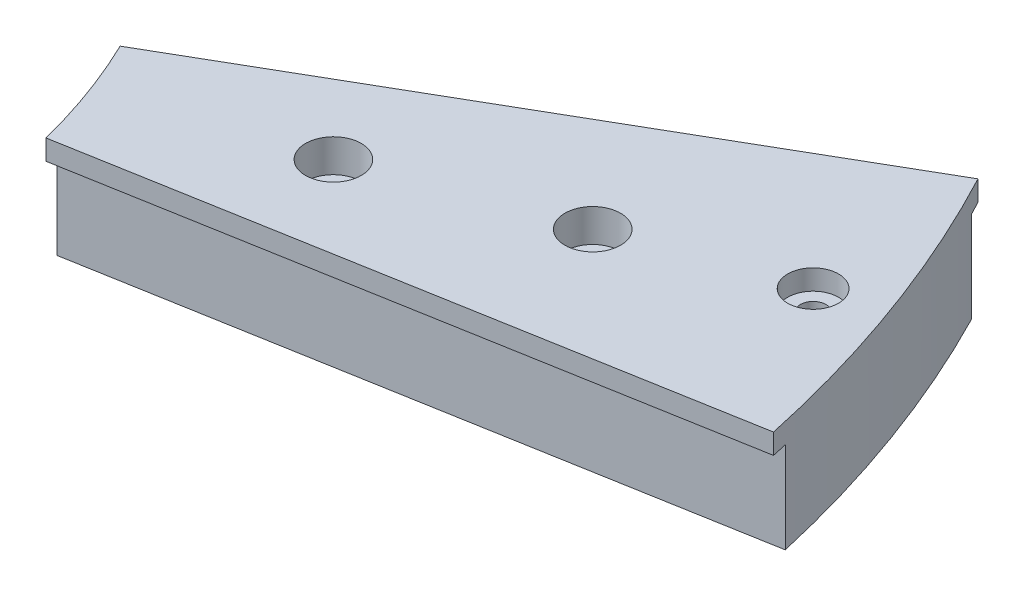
ISO-10303-21;
HEADER;
FILE_DESCRIPTION(('STEP AP214'),'2;1');
FILE_NAME('part.step','',(''),(''),'','','');
FILE_SCHEMA(('AUTOMOTIVE_DESIGN { 1 0 10303 214 1 1 1 1 }'));
ENDSEC;
DATA;
#1=APPLICATION_CONTEXT('core data for automotive mechanical design processes');
#2=APPLICATION_PROTOCOL_DEFINITION('international standard','automotive_design',2000,#1);
#3=PRODUCT_CONTEXT('',#1,'mechanical');
#4=PRODUCT('Part','Part','',(#3));
#5=PRODUCT_RELATED_PRODUCT_CATEGORY('part','',(#4));
#6=PRODUCT_DEFINITION_FORMATION('','',#4);
#7=PRODUCT_DEFINITION_CONTEXT('part definition',#1,'design');
#8=PRODUCT_DEFINITION('design','',#6,#7);
#9=PRODUCT_DEFINITION_SHAPE('','',#8);
#10=(LENGTH_UNIT() NAMED_UNIT(*) SI_UNIT(.MILLI.,.METRE.));
#11=(NAMED_UNIT(*) PLANE_ANGLE_UNIT() SI_UNIT($,.RADIAN.));
#12=(NAMED_UNIT(*) SI_UNIT($,.STERADIAN.) SOLID_ANGLE_UNIT());
#13=UNCERTAINTY_MEASURE_WITH_UNIT(LENGTH_MEASURE(1.E-05),#10,'distance_accuracy_value','');
#14=(GEOMETRIC_REPRESENTATION_CONTEXT(3) GLOBAL_UNCERTAINTY_ASSIGNED_CONTEXT((#13)) GLOBAL_UNIT_ASSIGNED_CONTEXT((#10,
#11,#12)) REPRESENTATION_CONTEXT('',''));
#15=CARTESIAN_POINT('',(0.,0.,0.));
#16=DIRECTION('',(0.,0.,1.));
#17=DIRECTION('',(1.,0.,0.));
#18=AXIS2_PLACEMENT_3D('',#15,#16,#17);
#19=CARTESIAN_POINT('',(0.,17.4625,0.));
#20=DIRECTION('',(0.,-1.,0.));
#21=DIRECTION('',(0.,0.,-1.));
#22=AXIS2_PLACEMENT_3D('',#19,#20,#21);
#23=CYLINDRICAL_SURFACE('',#22,96.8375);
#24=DIRECTION('',(0.,-1.,0.));
#25=VECTOR('',#24,1.);
#26=CARTESIAN_POINT('',(93.2378191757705,17.4625,-26.1574173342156));
#27=LINE('',#26,#25);
#28=CARTESIAN_POINT('',(93.2378191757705,14.2875,-26.1574173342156));
#29=VERTEX_POINT('',#28);
#30=CARTESIAN_POINT('',(93.2378191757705,0.,-26.1574173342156));
#31=VERTEX_POINT('',#30);
#32=EDGE_CURVE('E58',#29,#31,#27,.T.);
#33=ORIENTED_EDGE('',*,*,#32,.F.);
#34=CARTESIAN_POINT('',(0.,14.2875,0.));
#35=DIRECTION('',(0.,-1.,0.));
#36=DIRECTION('',(0.,0.,-1.));
#37=AXIS2_PLACEMENT_3D('',#34,#35,#36);
#38=CIRCLE('',#37,96.8375);
#39=CARTESIAN_POINT('',(93.8659717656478,14.2875,-23.8050572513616));
#40=VERTEX_POINT('',#39);
#41=EDGE_CURVE('E178',#40,#29,#38,.F.);
#42=ORIENTED_EDGE('',*,*,#41,.F.);
#43=DIRECTION('',(0.,-1.,0.));
#44=VECTOR('',#43,1.);
#45=CARTESIAN_POINT('',(93.8659717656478,17.4625,-23.8050572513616));
#46=LINE('',#45,#44);
#47=CARTESIAN_POINT('',(93.8659717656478,17.4625,-23.8050572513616));
#48=VERTEX_POINT('',#47);
#49=EDGE_CURVE('E205',#48,#40,#46,.T.);
#50=ORIENTED_EDGE('',*,*,#49,.F.);
#51=CARTESIAN_POINT('',(0.,17.4625,0.));
#52=DIRECTION('',(0.,-1.,0.));
#53=DIRECTION('',(0.,0.,1.));
#54=AXIS2_PLACEMENT_3D('',#51,#52,#53);
#55=CIRCLE('',#54,96.8375);
#56=CARTESIAN_POINT('',(87.2071019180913,17.4625,-42.1001517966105));
#57=VERTEX_POINT('',#56);
#58=EDGE_CURVE('E181',#57,#48,#55,.T.);
#59=ORIENTED_EDGE('',*,*,#58,.F.);
#60=DIRECTION('',(0.,-1.,0.));
#61=VECTOR('',#60,1.);
#62=CARTESIAN_POINT('',(87.2071019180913,17.4625,-42.1001517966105));
#63=LINE('',#62,#61);
#64=CARTESIAN_POINT('',(87.2071019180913,14.2875,-42.1001517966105));
#65=VERTEX_POINT('',#64);
#66=EDGE_CURVE('E191',#57,#65,#63,.T.);
#67=ORIENTED_EDGE('',*,*,#66,.T.);
#68=CARTESIAN_POINT('',(88.2379770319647,14.2875,-39.8943707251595));
#69=VERTEX_POINT('',#68);
#70=EDGE_CURVE('E175',#69,#65,#38,.F.);
#71=ORIENTED_EDGE('',*,*,#70,.F.);
#72=DIRECTION('',(0.,-1.,0.));
#73=VECTOR('',#72,1.);
#74=CARTESIAN_POINT('',(88.2379770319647,17.4625,-39.8943707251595));
#75=LINE('',#74,#73);
#76=CARTESIAN_POINT('',(88.2379770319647,0.,-39.8943707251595));
#77=VERTEX_POINT('',#76);
#78=EDGE_CURVE('E171',#77,#69,#75,.F.);
#79=ORIENTED_EDGE('',*,*,#78,.F.);
#80=CARTESIAN_POINT('',(0.,0.,0.));
#81=DIRECTION('',(0.,-1.,0.));
#82=DIRECTION('',(0.,0.,1.));
#83=AXIS2_PLACEMENT_3D('',#80,#81,#82);
#84=CIRCLE('',#83,96.8375);
#85=EDGE_CURVE('E192',#77,#31,#84,.T.);
#86=ORIENTED_EDGE('',*,*,#85,.T.);
#87=EDGE_LOOP('',(#33,#42,#50,#59,#67,#71,#79,#86));
#88=FACE_BOUND('',#87,.T.);
#89=ADVANCED_FACE('F34',(#88),#23,.F.);
#90=CARTESIAN_POINT('',(93.8659717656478,17.4625,-23.8050572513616));
#91=DIRECTION('',(-0.173648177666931,0.,-0.984807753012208));
#92=DIRECTION('',(-0.984807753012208,0.,0.173648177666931));
#93=AXIS2_PLACEMENT_3D('',#90,#91,#92);
#94=PLANE('',#93);
#95=DIRECTION('',(-0.984807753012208,0.,0.173648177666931));
#96=VECTOR('',#95,1.);
#97=CARTESIAN_POINT('',(93.8659717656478,14.2875,-23.8050572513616));
#98=LINE('',#97,#96);
#99=CARTESIAN_POINT('',(190.9267885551,14.2875,-40.9194980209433));
#100=VERTEX_POINT('',#99);
#101=EDGE_CURVE('E179',#100,#40,#98,.T.);
#102=ORIENTED_EDGE('',*,*,#101,.F.);
#103=DIRECTION('',(0.,-1.,0.));
#104=VECTOR('',#103,1.);
#105=CARTESIAN_POINT('',(190.9267885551,17.4625,-40.9194980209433));
#106=LINE('',#105,#104);
#107=CARTESIAN_POINT('',(190.9267885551,17.4625,-40.9194980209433));
#108=VERTEX_POINT('',#107);
#109=EDGE_CURVE('E202',#108,#100,#106,.T.);
#110=ORIENTED_EDGE('',*,*,#109,.F.);
#111=DIRECTION('',(0.984807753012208,0.,-0.173648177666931));
#112=VECTOR('',#111,1.);
#113=CARTESIAN_POINT('',(93.8659717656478,17.4625,-23.8050572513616));
#114=LINE('',#113,#112);
#115=EDGE_CURVE('E184',#48,#108,#114,.T.);
#116=ORIENTED_EDGE('',*,*,#115,.F.);
#117=ORIENTED_EDGE('',*,*,#49,.T.);
#118=EDGE_LOOP('',(#102,#110,#116,#117));
#119=FACE_BOUND('',#118,.T.);
#120=ADVANCED_FACE('F235',(#119),#94,.F.);
#121=CARTESIAN_POINT('',(0.,17.4625,0.));
#122=DIRECTION('',(0.,-1.,0.));
#123=DIRECTION('',(0.,0.,-1.));
#124=AXIS2_PLACEMENT_3D('',#121,#122,#123);
#125=CYLINDRICAL_SURFACE('',#124,195.2625);
#126=DIRECTION('',(0.,-1.,0.));
#127=VECTOR('',#126,1.);
#128=CARTESIAN_POINT('',(173.683813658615,17.4625,-89.2265475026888));
#129=LINE('',#128,#127);
#130=CARTESIAN_POINT('',(173.683813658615,14.2875,-89.2265475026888));
#131=VERTEX_POINT('',#130);
#132=CARTESIAN_POINT('',(173.683813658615,0.,-89.2265475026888));
#133=VERTEX_POINT('',#132);
#134=EDGE_CURVE('E50',#131,#133,#129,.T.);
#135=ORIENTED_EDGE('',*,*,#134,.F.);
#136=CARTESIAN_POINT('',(0.,14.2875,0.));
#137=DIRECTION('',(0.,-1.,0.));
#138=DIRECTION('',(0.,0.,-1.));
#139=AXIS2_PLACEMENT_3D('',#136,#137,#138);
#140=CIRCLE('',#139,195.2625);
#141=CARTESIAN_POINT('',(172.560951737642,14.2875,-91.379219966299));
#142=VERTEX_POINT('',#141);
#143=EDGE_CURVE('E173',#142,#131,#140,.T.);
#144=ORIENTED_EDGE('',*,*,#143,.F.);
#145=DIRECTION('',(0.,-1.,0.));
#146=VECTOR('',#145,1.);
#147=CARTESIAN_POINT('',(172.560951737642,17.4625,-91.3792199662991));
#148=LINE('',#147,#146);
#149=CARTESIAN_POINT('',(172.560951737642,17.4625,-91.3792199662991));
#150=VERTEX_POINT('',#149);
#151=EDGE_CURVE('E199',#150,#142,#148,.T.);
#152=ORIENTED_EDGE('',*,*,#151,.F.);
#153=CARTESIAN_POINT('',(0.,17.4625,0.));
#154=DIRECTION('',(0.,1.,0.));
#155=DIRECTION('',(0.,0.,1.));
#156=AXIS2_PLACEMENT_3D('',#153,#154,#155);
#157=CIRCLE('',#156,195.2625);
#158=EDGE_CURVE('E187',#108,#150,#157,.T.);
#159=ORIENTED_EDGE('',*,*,#158,.F.);
#160=ORIENTED_EDGE('',*,*,#109,.T.);
#161=CARTESIAN_POINT('',(190.40323950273,14.2875,-43.2903025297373));
#162=VERTEX_POINT('',#161);
#163=EDGE_CURVE('E176',#162,#100,#140,.T.);
#164=ORIENTED_EDGE('',*,*,#163,.F.);
#165=DIRECTION('',(0.,-1.,0.));
#166=VECTOR('',#165,1.);
#167=CARTESIAN_POINT('',(190.40323950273,17.4625,-43.2903025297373));
#168=LINE('',#167,#166);
#169=CARTESIAN_POINT('',(190.40323950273,0.,-43.2903025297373));
#170=VERTEX_POINT('',#169);
#171=EDGE_CURVE('E167',#170,#162,#168,.F.);
#172=ORIENTED_EDGE('',*,*,#171,.F.);
#173=CARTESIAN_POINT('',(0.,0.,0.));
#174=DIRECTION('',(0.,1.,0.));
#175=DIRECTION('',(0.,0.,1.));
#176=AXIS2_PLACEMENT_3D('',#173,#174,#175);
#177=CIRCLE('',#176,195.2625);
#178=EDGE_CURVE('E185',#170,#133,#177,.T.);
#179=ORIENTED_EDGE('',*,*,#178,.T.);
#180=EDGE_LOOP('',(#135,#144,#152,#159,#160,#164,#172,#179));
#181=FACE_BOUND('',#180,.T.);
#182=ADVANCED_FACE('F240',(#181),#125,.T.);
#183=CARTESIAN_POINT('',(87.2071019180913,17.4625,-42.1001517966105));
#184=DIRECTION('',(0.500000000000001,0.,0.866025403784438));
#185=DIRECTION('',(0.866025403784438,0.,-0.500000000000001));
#186=AXIS2_PLACEMENT_3D('',#183,#184,#185);
#187=PLANE('',#186);
#188=DIRECTION('',(0.866025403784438,0.,-0.500000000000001));
#189=VECTOR('',#188,1.);
#190=CARTESIAN_POINT('',(87.2071019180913,14.2875,-42.1001517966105));
#191=LINE('',#190,#189);
#192=EDGE_CURVE('E11',#65,#142,#191,.T.);
#193=ORIENTED_EDGE('',*,*,#192,.F.);
#194=ORIENTED_EDGE('',*,*,#66,.F.);
#195=DIRECTION('',(-0.866025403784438,0.,0.500000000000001));
#196=VECTOR('',#195,1.);
#197=CARTESIAN_POINT('',(87.2071019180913,17.4625,-42.1001517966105));
#198=LINE('',#197,#196);
#199=EDGE_CURVE('E189',#150,#57,#198,.T.);
#200=ORIENTED_EDGE('',*,*,#199,.F.);
#201=ORIENTED_EDGE('',*,*,#151,.T.);
#202=EDGE_LOOP('',(#193,#194,#200,#201));
#203=FACE_BOUND('',#202,.T.);
#204=ADVANCED_FACE('F267',(#203),#187,.F.);
#205=CARTESIAN_POINT('',(0.,0.,0.));
#206=DIRECTION('',(0.,1.,0.));
#207=DIRECTION('',(0.,0.,1.));
#208=AXIS2_PLACEMENT_3D('',#205,#206,#207);
#209=PLANE('',#208);
#210=CARTESIAN_POINT('',(166.994718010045,0.,-51.0554089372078));
#211=DIRECTION('',(0.,-1.,0.));
#212=DIRECTION('',(0.,0.,-1.));
#213=AXIS2_PLACEMENT_3D('',#210,#211,#212);
#214=CIRCLE('',#213,2.39395000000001);
#215=CARTESIAN_POINT('',(166.994718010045,0.,-53.4493589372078));
#216=VERTEX_POINT('',#215);
#217=EDGE_CURVE('E481',#216,#216,#214,.T.);
#218=ORIENTED_EDGE('',*,*,#217,.F.);
#219=EDGE_LOOP('',(#218));
#220=FACE_BOUND('',#219,.T.);
#221=CARTESIAN_POINT('',(102.291101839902,0.,-43.4199966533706));
#222=DIRECTION('',(0.,-1.,0.));
#223=DIRECTION('',(0.,0.,-1.));
#224=AXIS2_PLACEMENT_3D('',#221,#222,#223);
#225=CIRCLE('',#224,2.39395000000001);
#226=CARTESIAN_POINT('',(102.291101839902,0.,-45.8139466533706));
#227=VERTEX_POINT('',#226);
#228=EDGE_CURVE('E115',#227,#227,#225,.T.);
#229=ORIENTED_EDGE('',*,*,#228,.F.);
#230=EDGE_LOOP('',(#229));
#231=FACE_BOUND('',#230,.T.);
#232=CARTESIAN_POINT('',(149.176203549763,0.,-54.2956977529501));
#233=DIRECTION('',(0.,1.,0.));
#234=DIRECTION('',(0.,0.,1.));
#235=AXIS2_PLACEMENT_3D('',#232,#233,#234);
#236=CIRCLE('',#235,2.80670000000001);
#237=CARTESIAN_POINT('',(149.176203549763,0.,-51.4889977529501));
#238=VERTEX_POINT('',#237);
#239=EDGE_CURVE('E37',#238,#238,#236,.T.);
#240=ORIENTED_EDGE('',*,*,#239,.T.);
#241=EDGE_LOOP('',(#240));
#242=FACE_BOUND('',#241,.T.);
#243=CARTESIAN_POINT('',(119.34096283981,0.,-43.4365582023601));
#244=DIRECTION('',(0.,1.,0.));
#245=DIRECTION('',(0.,0.,1.));
#246=AXIS2_PLACEMENT_3D('',#243,#244,#245);
#247=CIRCLE('',#246,2.8067);
#248=CARTESIAN_POINT('',(119.34096283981,0.,-40.6298582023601));
#249=VERTEX_POINT('',#248);
#250=EDGE_CURVE('E152',#249,#249,#247,.T.);
#251=ORIENTED_EDGE('',*,*,#250,.T.);
#252=EDGE_LOOP('',(#251));
#253=FACE_BOUND('',#252,.T.);
#254=CARTESIAN_POINT('',(174.536158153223,0.,-63.5259663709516));
#255=DIRECTION('',(0.,1.,0.));
#256=DIRECTION('',(0.,0.,1.));
#257=AXIS2_PLACEMENT_3D('',#254,#255,#256);
#258=CIRCLE('',#257,2.0193);
#259=CARTESIAN_POINT('',(174.536158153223,0.,-61.5066663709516));
#260=VERTEX_POINT('',#259);
#261=EDGE_CURVE('E162',#260,#260,#258,.T.);
#262=ORIENTED_EDGE('',*,*,#261,.T.);
#263=EDGE_LOOP('',(#262));
#264=FACE_BOUND('',#263,.T.);
#265=DIRECTION('',(-0.866025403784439,0.,0.5));
#266=VECTOR('',#265,1.);
#267=CARTESIAN_POINT('',(4.78472499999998,0.,8.28738680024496));
#268=LINE('',#267,#266);
#269=EDGE_CURVE('E42',#133,#77,#268,.T.);
#270=ORIENTED_EDGE('',*,*,#269,.F.);
#271=ORIENTED_EDGE('',*,*,#178,.F.);
#272=DIRECTION('',(0.984807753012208,0.,-0.173648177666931));
#273=VECTOR('',#272,1.);
#274=CARTESIAN_POINT('',(-1.66171755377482,0.,-9.42406855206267));
#275=LINE('',#274,#273);
#276=EDGE_CURVE('E208',#31,#170,#275,.T.);
#277=ORIENTED_EDGE('',*,*,#276,.F.);
#278=ORIENTED_EDGE('',*,*,#85,.F.);
#279=EDGE_LOOP('',(#270,#271,#277,#278));
#280=FACE_BOUND('',#279,.T.);
#281=ADVANCED_FACE('F215',(#220,#231,#242,#253,#264,#280),#209,.F.);
#282=CARTESIAN_POINT('',(0.,17.4625,0.));
#283=DIRECTION('',(0.,1.,0.));
#284=DIRECTION('',(0.,0.,1.));
#285=AXIS2_PLACEMENT_3D('',#282,#283,#284);
#286=PLANE('',#285);
#287=CARTESIAN_POINT('',(149.176203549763,17.4624999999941,-54.2956977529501));
#288=DIRECTION('',(0.,1.,0.));
#289=DIRECTION('',(0.,0.,1.));
#290=AXIS2_PLACEMENT_3D('',#287,#288,#289);
#291=CIRCLE('',#290,4.36562500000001);
#292=CARTESIAN_POINT('',(149.176203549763,17.4624999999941,-49.9300727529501));
#293=VERTEX_POINT('',#292);
#294=EDGE_CURVE('E134',#293,#293,#291,.T.);
#295=ORIENTED_EDGE('',*,*,#294,.F.);
#296=EDGE_LOOP('',(#295));
#297=FACE_BOUND('',#296,.T.);
#298=CARTESIAN_POINT('',(119.34096283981,17.4624999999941,-43.4365582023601));
#299=DIRECTION('',(0.,1.,0.));
#300=DIRECTION('',(0.,0.,1.));
#301=AXIS2_PLACEMENT_3D('',#298,#299,#300);
#302=CIRCLE('',#301,4.36562500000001);
#303=CARTESIAN_POINT('',(119.34096283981,17.4624999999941,-39.0709332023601));
#304=VERTEX_POINT('',#303);
#305=EDGE_CURVE('E143',#304,#304,#302,.T.);
#306=ORIENTED_EDGE('',*,*,#305,.F.);
#307=EDGE_LOOP('',(#306));
#308=FACE_BOUND('',#307,.T.);
#309=CARTESIAN_POINT('',(174.536158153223,17.4624999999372,-63.5259663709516));
#310=DIRECTION('',(0.,1.,0.));
#311=DIRECTION('',(0.,0.,1.));
#312=AXIS2_PLACEMENT_3D('',#309,#310,#311);
#313=CIRCLE('',#312,3.98780000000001);
#314=CARTESIAN_POINT('',(174.536158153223,17.4624999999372,-59.5381663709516));
#315=VERTEX_POINT('',#314);
#316=EDGE_CURVE('E153',#315,#315,#313,.T.);
#317=ORIENTED_EDGE('',*,*,#316,.F.);
#318=EDGE_LOOP('',(#317));
#319=FACE_BOUND('',#318,.T.);
#320=ORIENTED_EDGE('',*,*,#58,.T.);
#321=ORIENTED_EDGE('',*,*,#115,.T.);
#322=ORIENTED_EDGE('',*,*,#158,.T.);
#323=ORIENTED_EDGE('',*,*,#199,.T.);
#324=EDGE_LOOP('',(#320,#321,#322,#323));
#325=FACE_BOUND('',#324,.T.);
#326=ADVANCED_FACE('F262',(#297,#308,#319,#325),#286,.T.);
#327=CARTESIAN_POINT('',(76.2,14.2875,-23.1531901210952));
#328=DIRECTION('',(0.173648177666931,0.,0.984807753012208));
#329=DIRECTION('',(0.984807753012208,0.,-0.173648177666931));
#330=AXIS2_PLACEMENT_3D('',#327,#328,#329);
#331=PLANE('',#330);
#332=ORIENTED_EDGE('',*,*,#32,.T.);
#333=ORIENTED_EDGE('',*,*,#276,.T.);
#334=ORIENTED_EDGE('',*,*,#171,.T.);
#335=DIRECTION('',(-0.984807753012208,0.,0.173648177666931));
#336=VECTOR('',#335,1.);
#337=CARTESIAN_POINT('',(76.2,14.2875,-23.1531901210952));
#338=LINE('',#337,#336);
#339=EDGE_CURVE('E165',#162,#29,#338,.T.);
#340=ORIENTED_EDGE('',*,*,#339,.T.);
#341=EDGE_LOOP('',(#332,#333,#334,#340));
#342=FACE_BOUND('',#341,.T.);
#343=ADVANCED_FACE('F250',(#342),#331,.T.);
#344=CARTESIAN_POINT('',(76.2,14.2875,-127.));
#345=DIRECTION('',(0.,-1.,0.));
#346=DIRECTION('',(0.,0.,-1.));
#347=AXIS2_PLACEMENT_3D('',#344,#345,#346);
#348=PLANE('',#347);
#349=ORIENTED_EDGE('',*,*,#41,.T.);
#350=ORIENTED_EDGE('',*,*,#339,.F.);
#351=ORIENTED_EDGE('',*,*,#163,.T.);
#352=ORIENTED_EDGE('',*,*,#101,.T.);
#353=EDGE_LOOP('',(#349,#350,#351,#352));
#354=FACE_BOUND('',#353,.T.);
#355=ADVANCED_FACE('F258',(#354),#348,.T.);
#356=ORIENTED_EDGE('',*,*,#70,.T.);
#357=ORIENTED_EDGE('',*,*,#192,.T.);
#358=ORIENTED_EDGE('',*,*,#143,.T.);
#359=DIRECTION('',(0.866025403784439,0.,-0.5));
#360=VECTOR('',#359,1.);
#361=CARTESIAN_POINT('',(76.2,14.2875,-32.9442414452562));
#362=LINE('',#361,#360);
#363=EDGE_CURVE('E163',#69,#131,#362,.T.);
#364=ORIENTED_EDGE('',*,*,#363,.F.);
#365=EDGE_LOOP('',(#356,#357,#358,#364));
#366=FACE_BOUND('',#365,.T.);
#367=ADVANCED_FACE('F270',(#366),#348,.T.);
#368=CARTESIAN_POINT('',(76.2,14.2875,-32.9442414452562));
#369=DIRECTION('',(-0.5,0.,-0.866025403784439));
#370=DIRECTION('',(-0.866025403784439,0.,0.5));
#371=AXIS2_PLACEMENT_3D('',#368,#369,#370);
#372=PLANE('',#371);
#373=ORIENTED_EDGE('',*,*,#78,.T.);
#374=ORIENTED_EDGE('',*,*,#363,.T.);
#375=ORIENTED_EDGE('',*,*,#134,.T.);
#376=ORIENTED_EDGE('',*,*,#269,.T.);
#377=EDGE_LOOP('',(#373,#374,#375,#376));
#378=FACE_BOUND('',#377,.T.);
#379=ADVANCED_FACE('F272',(#378),#372,.T.);
#380=CARTESIAN_POINT('',(174.536158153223,17.4624999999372,-63.5259663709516));
#381=DIRECTION('',(0.,1.,0.));
#382=DIRECTION('',(0.,0.,1.));
#383=AXIS2_PLACEMENT_3D('',#380,#381,#382);
#384=CYLINDRICAL_SURFACE('',#383,2.0193);
#385=CARTESIAN_POINT('',(174.536158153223,14.2874999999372,-63.5259663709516));
#386=DIRECTION('',(0.,1.,0.));
#387=DIRECTION('',(0.,0.,1.));
#388=AXIS2_PLACEMENT_3D('',#385,#386,#387);
#389=CIRCLE('',#388,2.0193);
#390=CARTESIAN_POINT('',(174.536158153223,14.2874999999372,-61.5066663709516));
#391=VERTEX_POINT('',#390);
#392=EDGE_CURVE('E159',#391,#391,#389,.T.);
#393=ORIENTED_EDGE('',*,*,#392,.T.);
#394=EDGE_LOOP('',(#393));
#395=FACE_BOUND('',#394,.T.);
#396=ORIENTED_EDGE('',*,*,#261,.F.);
#397=EDGE_LOOP('',(#396));
#398=FACE_BOUND('',#397,.T.);
#399=ADVANCED_FACE('F274',(#395,#398),#384,.F.);
#400=CARTESIAN_POINT('',(176.555458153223,14.2874999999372,-63.5259663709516));
#401=DIRECTION('',(0.,-1.,0.));
#402=DIRECTION('',(0.,0.,-1.));
#403=AXIS2_PLACEMENT_3D('',#400,#401,#402);
#404=PLANE('',#403);
#405=ORIENTED_EDGE('',*,*,#392,.F.);
#406=EDGE_LOOP('',(#405));
#407=FACE_BOUND('',#406,.T.);
#408=CARTESIAN_POINT('',(174.536158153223,14.2874999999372,-63.5259663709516));
#409=DIRECTION('',(0.,1.,0.));
#410=DIRECTION('',(0.,0.,1.));
#411=AXIS2_PLACEMENT_3D('',#408,#409,#410);
#412=CIRCLE('',#411,3.98780000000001);
#413=CARTESIAN_POINT('',(174.536158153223,14.2874999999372,-59.5381663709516));
#414=VERTEX_POINT('',#413);
#415=EDGE_CURVE('E156',#414,#414,#412,.T.);
#416=ORIENTED_EDGE('',*,*,#415,.T.);
#417=EDGE_LOOP('',(#416));
#418=FACE_BOUND('',#417,.T.);
#419=ADVANCED_FACE('F231',(#407,#418),#404,.F.);
#420=CARTESIAN_POINT('',(174.536158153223,17.4624999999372,-63.5259663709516));
#421=DIRECTION('',(0.,1.,0.));
#422=DIRECTION('',(0.,0.,1.));
#423=AXIS2_PLACEMENT_3D('',#420,#421,#422);
#424=CYLINDRICAL_SURFACE('',#423,3.98780000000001);
#425=ORIENTED_EDGE('',*,*,#415,.F.);
#426=EDGE_LOOP('',(#425));
#427=FACE_BOUND('',#426,.T.);
#428=ORIENTED_EDGE('',*,*,#316,.T.);
#429=EDGE_LOOP('',(#428));
#430=FACE_BOUND('',#429,.T.);
#431=ADVANCED_FACE('F221',(#427,#430),#424,.F.);
#432=CARTESIAN_POINT('',(119.34096283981,17.4624999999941,-43.4365582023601));
#433=DIRECTION('',(0.,1.,0.));
#434=DIRECTION('',(0.,0.,1.));
#435=AXIS2_PLACEMENT_3D('',#432,#433,#434);
#436=CYLINDRICAL_SURFACE('',#435,2.8067);
#437=CARTESIAN_POINT('',(119.34096283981,12.3031249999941,-43.4365582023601));
#438=DIRECTION('',(0.,1.,0.));
#439=DIRECTION('',(0.,0.,1.));
#440=AXIS2_PLACEMENT_3D('',#437,#438,#439);
#441=CIRCLE('',#440,2.80670000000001);
#442=CARTESIAN_POINT('',(119.34096283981,12.3031249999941,-40.6298582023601));
#443=VERTEX_POINT('',#442);
#444=EDGE_CURVE('E149',#443,#443,#441,.T.);
#445=ORIENTED_EDGE('',*,*,#444,.T.);
#446=EDGE_LOOP('',(#445));
#447=FACE_BOUND('',#446,.T.);
#448=ORIENTED_EDGE('',*,*,#250,.F.);
#449=EDGE_LOOP('',(#448));
#450=FACE_BOUND('',#449,.T.);
#451=ADVANCED_FACE('F218',(#447,#450),#436,.F.);
#452=CARTESIAN_POINT('',(122.14766283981,12.3031249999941,-43.4365582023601));
#453=DIRECTION('',(0.,-1.,0.));
#454=DIRECTION('',(0.,0.,-1.));
#455=AXIS2_PLACEMENT_3D('',#452,#453,#454);
#456=PLANE('',#455);
#457=ORIENTED_EDGE('',*,*,#444,.F.);
#458=EDGE_LOOP('',(#457));
#459=FACE_BOUND('',#458,.T.);
#460=CARTESIAN_POINT('',(119.34096283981,12.3031249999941,-43.4365582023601));
#461=DIRECTION('',(0.,1.,0.));
#462=DIRECTION('',(0.,0.,1.));
#463=AXIS2_PLACEMENT_3D('',#460,#461,#462);
#464=CIRCLE('',#463,4.36562500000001);
#465=CARTESIAN_POINT('',(119.34096283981,12.3031249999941,-39.0709332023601));
#466=VERTEX_POINT('',#465);
#467=EDGE_CURVE('E146',#466,#466,#464,.T.);
#468=ORIENTED_EDGE('',*,*,#467,.T.);
#469=EDGE_LOOP('',(#468));
#470=FACE_BOUND('',#469,.T.);
#471=ADVANCED_FACE('F220',(#459,#470),#456,.F.);
#472=CARTESIAN_POINT('',(119.34096283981,17.4624999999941,-43.4365582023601));
#473=DIRECTION('',(0.,1.,0.));
#474=DIRECTION('',(0.,0.,1.));
#475=AXIS2_PLACEMENT_3D('',#472,#473,#474);
#476=CYLINDRICAL_SURFACE('',#475,4.36562500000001);
#477=ORIENTED_EDGE('',*,*,#467,.F.);
#478=EDGE_LOOP('',(#477));
#479=FACE_BOUND('',#478,.T.);
#480=ORIENTED_EDGE('',*,*,#305,.T.);
#481=EDGE_LOOP('',(#480));
#482=FACE_BOUND('',#481,.T.);
#483=ADVANCED_FACE('F228',(#479,#482),#476,.F.);
#484=CARTESIAN_POINT('',(149.176203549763,17.4624999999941,-54.2956977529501));
#485=DIRECTION('',(0.,1.,0.));
#486=DIRECTION('',(0.,0.,1.));
#487=AXIS2_PLACEMENT_3D('',#484,#485,#486);
#488=CYLINDRICAL_SURFACE('',#487,2.80670000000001);
#489=CARTESIAN_POINT('',(149.176203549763,12.3031249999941,-54.2956977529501));
#490=DIRECTION('',(0.,1.,0.));
#491=DIRECTION('',(0.,0.,1.));
#492=AXIS2_PLACEMENT_3D('',#489,#490,#491);
#493=CIRCLE('',#492,2.80670000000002);
#494=CARTESIAN_POINT('',(149.176203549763,12.3031249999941,-51.4889977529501));
#495=VERTEX_POINT('',#494);
#496=EDGE_CURVE('E140',#495,#495,#493,.T.);
#497=ORIENTED_EDGE('',*,*,#496,.T.);
#498=EDGE_LOOP('',(#497));
#499=FACE_BOUND('',#498,.T.);
#500=ORIENTED_EDGE('',*,*,#239,.F.);
#501=EDGE_LOOP('',(#500));
#502=FACE_BOUND('',#501,.T.);
#503=ADVANCED_FACE('F371',(#499,#502),#488,.F.);
#504=CARTESIAN_POINT('',(151.982903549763,12.3031249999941,-54.2956977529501));
#505=DIRECTION('',(0.,-1.,0.));
#506=DIRECTION('',(0.,0.,-1.));
#507=AXIS2_PLACEMENT_3D('',#504,#505,#506);
#508=PLANE('',#507);
#509=ORIENTED_EDGE('',*,*,#496,.F.);
#510=EDGE_LOOP('',(#509));
#511=FACE_BOUND('',#510,.T.);
#512=CARTESIAN_POINT('',(149.176203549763,12.3031249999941,-54.2956977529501));
#513=DIRECTION('',(0.,1.,0.));
#514=DIRECTION('',(0.,0.,1.));
#515=AXIS2_PLACEMENT_3D('',#512,#513,#514);
#516=CIRCLE('',#515,4.36562500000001);
#517=CARTESIAN_POINT('',(149.176203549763,12.3031249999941,-49.9300727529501));
#518=VERTEX_POINT('',#517);
#519=EDGE_CURVE('E137',#518,#518,#516,.T.);
#520=ORIENTED_EDGE('',*,*,#519,.T.);
#521=EDGE_LOOP('',(#520));
#522=FACE_BOUND('',#521,.T.);
#523=ADVANCED_FACE('F381',(#511,#522),#508,.F.);
#524=CARTESIAN_POINT('',(149.176203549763,17.4624999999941,-54.2956977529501));
#525=DIRECTION('',(0.,1.,0.));
#526=DIRECTION('',(0.,0.,1.));
#527=AXIS2_PLACEMENT_3D('',#524,#525,#526);
#528=CYLINDRICAL_SURFACE('',#527,4.36562500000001);
#529=ORIENTED_EDGE('',*,*,#519,.F.);
#530=EDGE_LOOP('',(#529));
#531=FACE_BOUND('',#530,.T.);
#532=ORIENTED_EDGE('',*,*,#294,.T.);
#533=EDGE_LOOP('',(#532));
#534=FACE_BOUND('',#533,.T.);
#535=ADVANCED_FACE('F388',(#531,#534),#528,.F.);
#536=CARTESIAN_POINT('',(102.291101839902,14.2875,-43.4199966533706));
#537=DIRECTION('',(0.,-1.,0.));
#538=DIRECTION('',(0.,0.,-1.));
#539=AXIS2_PLACEMENT_3D('',#536,#537,#538);
#540=CONICAL_SURFACE('',#539,2.18281250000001,1.02974425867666);
#541=CARTESIAN_POINT('',(102.291101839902,15.5990660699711,-43.4199966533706));
#542=VERTEX_POINT('',#541);
#543=VERTEX_LOOP('',#542);
#544=FACE_BOUND('',#543,.T.);
#545=CARTESIAN_POINT('',(102.291101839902,14.2875,-43.4199966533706));
#546=DIRECTION('',(0.,-1.,0.));
#547=DIRECTION('',(0.,0.,-1.));
#548=AXIS2_PLACEMENT_3D('',#545,#546,#547);
#549=CIRCLE('',#548,2.18281250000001);
#550=CARTESIAN_POINT('',(102.291101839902,14.2875,-45.6028091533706));
#551=VERTEX_POINT('',#550);
#552=EDGE_CURVE('E131',#551,#551,#549,.T.);
#553=ORIENTED_EDGE('',*,*,#552,.T.);
#554=EDGE_LOOP('',(#553));
#555=FACE_BOUND('',#554,.T.);
#556=ADVANCED_FACE('F396',(#544,#555),#540,.F.);
#557=CARTESIAN_POINT('',(102.291101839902,0.,-43.4199966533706));
#558=DIRECTION('',(0.,-1.,0.));
#559=DIRECTION('',(0.,0.,-1.));
#560=AXIS2_PLACEMENT_3D('',#557,#558,#559);
#561=CYLINDRICAL_SURFACE('',#560,2.18281250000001);
#562=ORIENTED_EDGE('',*,*,#552,.F.);
#563=EDGE_LOOP('',(#562));
#564=FACE_BOUND('',#563,.T.);
#565=CARTESIAN_POINT('',(102.291101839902,7.14375,-43.4199966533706));
#566=DIRECTION('',(0.,-1.,0.));
#567=DIRECTION('',(0.,0.,-1.));
#568=AXIS2_PLACEMENT_3D('',#565,#566,#567);
#569=CIRCLE('',#568,2.18281250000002);
#570=CARTESIAN_POINT('',(102.291101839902,7.14375,-45.6028091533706));
#571=VERTEX_POINT('',#570);
#572=EDGE_CURVE('E128',#571,#571,#569,.T.);
#573=ORIENTED_EDGE('',*,*,#572,.T.);
#574=EDGE_LOOP('',(#573));
#575=FACE_BOUND('',#574,.T.);
#576=ADVANCED_FACE('F404',(#564,#575),#561,.F.);
#577=CARTESIAN_POINT('',(104.473914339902,7.14375,-43.4199966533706));
#578=DIRECTION('',(0.,1.,0.));
#579=DIRECTION('',(0.,0.,1.));
#580=AXIS2_PLACEMENT_3D('',#577,#578,#579);
#581=PLANE('',#580);
#582=ORIENTED_EDGE('',*,*,#572,.F.);
#583=EDGE_LOOP('',(#582));
#584=FACE_BOUND('',#583,.T.);
#585=CARTESIAN_POINT('',(102.291101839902,7.14375,-43.4199966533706));
#586=DIRECTION('',(0.,-1.,0.));
#587=DIRECTION('',(0.,0.,-1.));
#588=AXIS2_PLACEMENT_3D('',#585,#586,#587);
#589=CIRCLE('',#588,2.39395000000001);
#590=CARTESIAN_POINT('',(102.291101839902,7.14375,-45.8139466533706));
#591=VERTEX_POINT('',#590);
#592=EDGE_CURVE('E119',#591,#591,#589,.T.);
#593=ORIENTED_EDGE('',*,*,#592,.T.);
#594=EDGE_LOOP('',(#593));
#595=FACE_BOUND('',#594,.T.);
#596=ADVANCED_FACE('F412',(#584,#595),#581,.F.);
#597=CARTESIAN_POINT('',(102.291101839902,0.,-43.4199966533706));
#598=DIRECTION('',(0.,-1.,0.));
#599=DIRECTION('',(0.,0.,-1.));
#600=AXIS2_PLACEMENT_3D('',#597,#598,#599);
#601=CYLINDRICAL_SURFACE('',#600,2.39395000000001);
#602=ORIENTED_EDGE('',*,*,#592,.F.);
#603=EDGE_LOOP('',(#602));
#604=FACE_BOUND('',#603,.T.);
#605=ORIENTED_EDGE('',*,*,#228,.T.);
#606=EDGE_LOOP('',(#605));
#607=FACE_BOUND('',#606,.T.);
#608=ADVANCED_FACE('F109',(#604,#607),#601,.F.);
#609=CARTESIAN_POINT('',(166.994718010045,14.2875,-51.0554089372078));
#610=DIRECTION('',(0.,-1.,0.));
#611=DIRECTION('',(0.,0.,-1.));
#612=AXIS2_PLACEMENT_3D('',#609,#610,#611);
#613=CONICAL_SURFACE('',#612,2.18281249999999,1.02974425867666);
#614=CARTESIAN_POINT('',(166.994718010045,15.5990660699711,-51.0554089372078));
#615=VERTEX_POINT('',#614);
#616=VERTEX_LOOP('',#615);
#617=FACE_BOUND('',#616,.T.);
#618=CARTESIAN_POINT('',(166.994718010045,14.2875,-51.0554089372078));
#619=DIRECTION('',(0.,-1.,0.));
#620=DIRECTION('',(0.,0.,-1.));
#621=AXIS2_PLACEMENT_3D('',#618,#619,#620);
#622=CIRCLE('',#621,2.18281249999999);
#623=CARTESIAN_POINT('',(166.994718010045,14.2875,-53.2382214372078));
#624=VERTEX_POINT('',#623);
#625=EDGE_CURVE('E113',#624,#624,#622,.T.);
#626=ORIENTED_EDGE('',*,*,#625,.T.);
#627=EDGE_LOOP('',(#626));
#628=FACE_BOUND('',#627,.T.);
#629=ADVANCED_FACE('F105',(#617,#628),#613,.F.);
#630=CARTESIAN_POINT('',(166.994718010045,0.,-51.0554089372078));
#631=DIRECTION('',(0.,-1.,0.));
#632=DIRECTION('',(0.,0.,-1.));
#633=AXIS2_PLACEMENT_3D('',#630,#631,#632);
#634=CYLINDRICAL_SURFACE('',#633,2.18281250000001);
#635=ORIENTED_EDGE('',*,*,#625,.F.);
#636=EDGE_LOOP('',(#635));
#637=FACE_BOUND('',#636,.T.);
#638=CARTESIAN_POINT('',(166.994718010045,7.14375,-51.0554089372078));
#639=DIRECTION('',(0.,-1.,0.));
#640=DIRECTION('',(0.,0.,-1.));
#641=AXIS2_PLACEMENT_3D('',#638,#639,#640);
#642=CIRCLE('',#641,2.18281250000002);
#643=CARTESIAN_POINT('',(166.994718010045,7.14375,-53.2382214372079));
#644=VERTEX_POINT('',#643);
#645=EDGE_CURVE('E116',#644,#644,#642,.T.);
#646=ORIENTED_EDGE('',*,*,#645,.T.);
#647=EDGE_LOOP('',(#646));
#648=FACE_BOUND('',#647,.T.);
#649=ADVANCED_FACE('F108',(#637,#648),#634,.F.);
#650=CARTESIAN_POINT('',(169.177530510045,7.14375,-51.0554089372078));
#651=DIRECTION('',(0.,1.,0.));
#652=DIRECTION('',(0.,0.,1.));
#653=AXIS2_PLACEMENT_3D('',#650,#651,#652);
#654=PLANE('',#653);
#655=ORIENTED_EDGE('',*,*,#645,.F.);
#656=EDGE_LOOP('',(#655));
#657=FACE_BOUND('',#656,.T.);
#658=CARTESIAN_POINT('',(166.994718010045,7.14375,-51.0554089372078));
#659=DIRECTION('',(0.,-1.,0.));
#660=DIRECTION('',(0.,0.,-1.));
#661=AXIS2_PLACEMENT_3D('',#658,#659,#660);
#662=CIRCLE('',#661,2.39395000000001);
#663=CARTESIAN_POINT('',(166.994718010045,7.14375,-53.4493589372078));
#664=VERTEX_POINT('',#663);
#665=EDGE_CURVE('E122',#664,#664,#662,.T.);
#666=ORIENTED_EDGE('',*,*,#665,.T.);
#667=EDGE_LOOP('',(#666));
#668=FACE_BOUND('',#667,.T.);
#669=ADVANCED_FACE('F436',(#657,#668),#654,.F.);
#670=CARTESIAN_POINT('',(166.994718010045,0.,-51.0554089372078));
#671=DIRECTION('',(0.,-1.,0.));
#672=DIRECTION('',(0.,0.,-1.));
#673=AXIS2_PLACEMENT_3D('',#670,#671,#672);
#674=CYLINDRICAL_SURFACE('',#673,2.39395000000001);
#675=ORIENTED_EDGE('',*,*,#665,.F.);
#676=EDGE_LOOP('',(#675));
#677=FACE_BOUND('',#676,.T.);
#678=ORIENTED_EDGE('',*,*,#217,.T.);
#679=EDGE_LOOP('',(#678));
#680=FACE_BOUND('',#679,.T.);
#681=ADVANCED_FACE('F443',(#677,#680),#674,.F.);
#682=CLOSED_SHELL('',(#89,#120,#182,#204,#281,#326,#343,#355,#367,#379,#399,#419,#431,#451,#471,
#483,#503,#523,#535,#556,#576,#596,#608,#629,#649,#669,#681));
#683=MANIFOLD_SOLID_BREP('B2',#682);
#684=ADVANCED_BREP_SHAPE_REPRESENTATION('',(#18,#683),#14);
#685=SHAPE_DEFINITION_REPRESENTATION(#9,#684);
ENDSEC;
END-ISO-10303-21;
